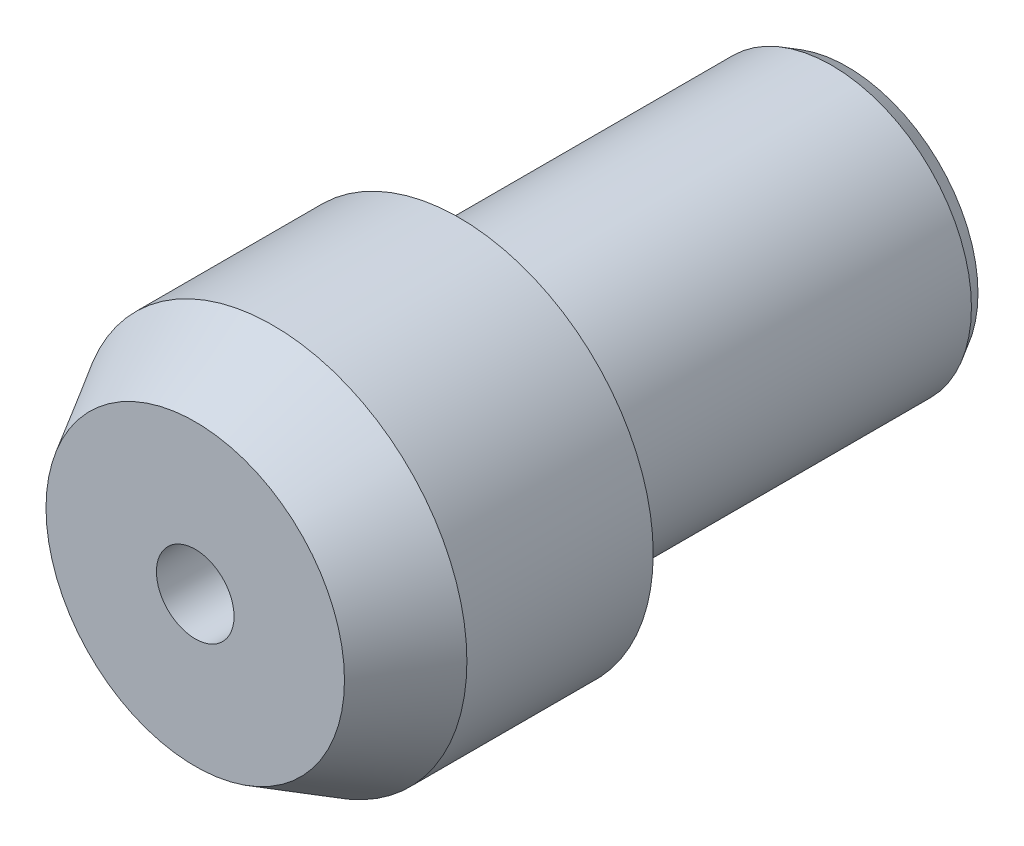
ISO-10303-21;
HEADER;
FILE_DESCRIPTION(('STEP AP214'),'2;1');
FILE_NAME('part.step','',(''),(''),'','','');
FILE_SCHEMA(('AUTOMOTIVE_DESIGN { 1 0 10303 214 1 1 1 1 }'));
ENDSEC;
DATA;
#1=APPLICATION_CONTEXT('core data for automotive mechanical design processes');
#2=APPLICATION_PROTOCOL_DEFINITION('international standard','automotive_design',2000,#1);
#3=PRODUCT_CONTEXT('',#1,'mechanical');
#4=PRODUCT('Part','Part','',(#3));
#5=PRODUCT_RELATED_PRODUCT_CATEGORY('part','',(#4));
#6=PRODUCT_DEFINITION_FORMATION('','',#4);
#7=PRODUCT_DEFINITION_CONTEXT('part definition',#1,'design');
#8=PRODUCT_DEFINITION('design','',#6,#7);
#9=PRODUCT_DEFINITION_SHAPE('','',#8);
#10=(LENGTH_UNIT() NAMED_UNIT(*) SI_UNIT(.MILLI.,.METRE.));
#11=(NAMED_UNIT(*) PLANE_ANGLE_UNIT() SI_UNIT($,.RADIAN.));
#12=(NAMED_UNIT(*) SI_UNIT($,.STERADIAN.) SOLID_ANGLE_UNIT());
#13=UNCERTAINTY_MEASURE_WITH_UNIT(LENGTH_MEASURE(1.E-05),#10,'distance_accuracy_value','');
#14=(GEOMETRIC_REPRESENTATION_CONTEXT(3) GLOBAL_UNCERTAINTY_ASSIGNED_CONTEXT((#13)) GLOBAL_UNIT_ASSIGNED_CONTEXT((#10,
#11,#12)) REPRESENTATION_CONTEXT('',''));
#15=CARTESIAN_POINT('',(0.,0.,0.));
#16=DIRECTION('',(0.,0.,1.));
#17=DIRECTION('',(1.,0.,0.));
#18=AXIS2_PLACEMENT_3D('',#15,#16,#17);
#19=CARTESIAN_POINT('',(0.,0.,-24.));
#20=DIRECTION('',(0.,0.,1.));
#21=DIRECTION('',(1.,0.,0.));
#22=AXIS2_PLACEMENT_3D('',#19,#20,#21);
#23=CONICAL_SURFACE('',#22,9.,0.523598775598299);
#24=CARTESIAN_POINT('',(0.,0.,-25.));
#25=DIRECTION('',(0.,0.,1.));
#26=DIRECTION('',(1.,0.,0.));
#27=AXIS2_PLACEMENT_3D('',#24,#25,#26);
#28=CIRCLE('',#27,8.42264973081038);
#29=CARTESIAN_POINT('',(8.42264973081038,0.,-25.));
#30=VERTEX_POINT('',#29);
#31=EDGE_CURVE('E43',#30,#30,#28,.T.);
#32=ORIENTED_EDGE('',*,*,#31,.T.);
#33=EDGE_LOOP('',(#32));
#34=FACE_BOUND('',#33,.T.);
#35=CARTESIAN_POINT('',(0.,0.,-24.));
#36=DIRECTION('',(0.,0.,1.));
#37=DIRECTION('',(1.,0.,0.));
#38=AXIS2_PLACEMENT_3D('',#35,#36,#37);
#39=CIRCLE('',#38,9.);
#40=CARTESIAN_POINT('',(9.,0.,-24.));
#41=VERTEX_POINT('',#40);
#42=EDGE_CURVE('E8',#41,#41,#39,.T.);
#43=ORIENTED_EDGE('',*,*,#42,.F.);
#44=EDGE_LOOP('',(#43));
#45=FACE_BOUND('',#44,.T.);
#46=ADVANCED_FACE('F12',(#34,#45),#23,.T.);
#47=CARTESIAN_POINT('',(0.,0.,20.));
#48=DIRECTION('',(0.,0.,1.));
#49=DIRECTION('',(1.,0.,0.));
#50=AXIS2_PLACEMENT_3D('',#47,#48,#49);
#51=CYLINDRICAL_SURFACE('',#50,9.);
#52=ORIENTED_EDGE('',*,*,#42,.T.);
#53=EDGE_LOOP('',(#52));
#54=FACE_BOUND('',#53,.T.);
#55=CARTESIAN_POINT('',(0.,0.,0.));
#56=DIRECTION('',(0.,0.,1.));
#57=DIRECTION('',(1.,0.,0.));
#58=AXIS2_PLACEMENT_3D('',#55,#56,#57);
#59=CIRCLE('',#58,9.);
#60=CARTESIAN_POINT('',(9.,0.,0.));
#61=VERTEX_POINT('',#60);
#62=EDGE_CURVE('E18',#61,#61,#59,.T.);
#63=ORIENTED_EDGE('',*,*,#62,.F.);
#64=EDGE_LOOP('',(#63));
#65=FACE_BOUND('',#64,.T.);
#66=ADVANCED_FACE('F72',(#54,#65),#51,.T.);
#67=CARTESIAN_POINT('',(9.,0.,0.));
#68=DIRECTION('',(0.,0.,1.));
#69=DIRECTION('',(1.,0.,0.));
#70=AXIS2_PLACEMENT_3D('',#67,#68,#69);
#71=PLANE('',#70);
#72=CARTESIAN_POINT('',(0.,0.,0.));
#73=DIRECTION('',(0.,0.,1.));
#74=DIRECTION('',(1.,0.,0.));
#75=AXIS2_PLACEMENT_3D('',#72,#73,#74);
#76=CIRCLE('',#75,12.5);
#77=CARTESIAN_POINT('',(12.5,0.,0.));
#78=VERTEX_POINT('',#77);
#79=EDGE_CURVE('E22',#78,#78,#76,.T.);
#80=ORIENTED_EDGE('',*,*,#79,.F.);
#81=EDGE_LOOP('',(#80));
#82=FACE_BOUND('',#81,.T.);
#83=ORIENTED_EDGE('',*,*,#62,.T.);
#84=EDGE_LOOP('',(#83));
#85=FACE_BOUND('',#84,.T.);
#86=ADVANCED_FACE('F77',(#82,#85),#71,.F.);
#87=CARTESIAN_POINT('',(0.,0.,20.));
#88=DIRECTION('',(0.,0.,1.));
#89=DIRECTION('',(1.,0.,0.));
#90=AXIS2_PLACEMENT_3D('',#87,#88,#89);
#91=CYLINDRICAL_SURFACE('',#90,12.5);
#92=ORIENTED_EDGE('',*,*,#79,.T.);
#93=EDGE_LOOP('',(#92));
#94=FACE_BOUND('',#93,.T.);
#95=CARTESIAN_POINT('',(0.,0.,12.));
#96=DIRECTION('',(0.,0.,1.));
#97=DIRECTION('',(1.,0.,0.));
#98=AXIS2_PLACEMENT_3D('',#95,#96,#97);
#99=CIRCLE('',#98,12.5);
#100=CARTESIAN_POINT('',(12.5,0.,12.));
#101=VERTEX_POINT('',#100);
#102=EDGE_CURVE('E26',#101,#101,#99,.T.);
#103=ORIENTED_EDGE('',*,*,#102,.F.);
#104=EDGE_LOOP('',(#103));
#105=FACE_BOUND('',#104,.T.);
#106=ADVANCED_FACE('F68',(#94,#105),#91,.T.);
#107=CARTESIAN_POINT('',(0.,0.,12.));
#108=DIRECTION('',(0.,0.,-1.));
#109=DIRECTION('',(-1.,0.,0.));
#110=AXIS2_PLACEMENT_3D('',#107,#108,#109);
#111=CONICAL_SURFACE('',#110,12.5,0.523598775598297);
#112=CARTESIAN_POINT('',(0.,0.,17.));
#113=DIRECTION('',(0.,0.,1.));
#114=DIRECTION('',(1.,0.,0.));
#115=AXIS2_PLACEMENT_3D('',#112,#113,#114);
#116=CIRCLE('',#115,9.61324865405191);
#117=CARTESIAN_POINT('',(9.61324865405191,0.,17.));
#118=VERTEX_POINT('',#117);
#119=EDGE_CURVE('E31',#118,#118,#116,.T.);
#120=ORIENTED_EDGE('',*,*,#119,.F.);
#121=EDGE_LOOP('',(#120));
#122=FACE_BOUND('',#121,.T.);
#123=ORIENTED_EDGE('',*,*,#102,.T.);
#124=EDGE_LOOP('',(#123));
#125=FACE_BOUND('',#124,.T.);
#126=ADVANCED_FACE('F61',(#122,#125),#111,.T.);
#127=CARTESIAN_POINT('',(2.5,0.,17.));
#128=DIRECTION('',(0.,0.,1.));
#129=DIRECTION('',(1.,0.,0.));
#130=AXIS2_PLACEMENT_3D('',#127,#128,#129);
#131=PLANE('',#130);
#132=ORIENTED_EDGE('',*,*,#119,.T.);
#133=EDGE_LOOP('',(#132));
#134=FACE_BOUND('',#133,.T.);
#135=CARTESIAN_POINT('',(0.,0.,17.));
#136=DIRECTION('',(0.,0.,1.));
#137=DIRECTION('',(1.,0.,0.));
#138=AXIS2_PLACEMENT_3D('',#135,#136,#137);
#139=CIRCLE('',#138,2.5);
#140=CARTESIAN_POINT('',(2.5,0.,17.));
#141=VERTEX_POINT('',#140);
#142=EDGE_CURVE('E34',#141,#141,#139,.T.);
#143=ORIENTED_EDGE('',*,*,#142,.F.);
#144=EDGE_LOOP('',(#143));
#145=FACE_BOUND('',#144,.T.);
#146=ADVANCED_FACE('F56',(#134,#145),#131,.T.);
#147=CARTESIAN_POINT('',(0.,0.,20.));
#148=DIRECTION('',(0.,0.,1.));
#149=DIRECTION('',(1.,0.,0.));
#150=AXIS2_PLACEMENT_3D('',#147,#148,#149);
#151=CYLINDRICAL_SURFACE('',#150,2.5);
#152=CARTESIAN_POINT('',(0.,0.,9.));
#153=DIRECTION('',(0.,0.,1.));
#154=DIRECTION('',(1.,0.,0.));
#155=AXIS2_PLACEMENT_3D('',#152,#153,#154);
#156=CIRCLE('',#155,2.5);
#157=CARTESIAN_POINT('',(2.5,0.,9.));
#158=VERTEX_POINT('',#157);
#159=EDGE_CURVE('E46',#158,#158,#156,.T.);
#160=ORIENTED_EDGE('',*,*,#159,.F.);
#161=EDGE_LOOP('',(#160));
#162=FACE_BOUND('',#161,.T.);
#163=ORIENTED_EDGE('',*,*,#142,.T.);
#164=EDGE_LOOP('',(#163));
#165=FACE_BOUND('',#164,.T.);
#166=ADVANCED_FACE('F52',(#162,#165),#151,.F.);
#167=CARTESIAN_POINT('',(0.,0.,-21.));
#168=DIRECTION('',(0.,0.,1.));
#169=DIRECTION('',(1.,0.,0.));
#170=AXIS2_PLACEMENT_3D('',#167,#168,#169);
#171=PLANE('',#170);
#172=CARTESIAN_POINT('',(0.,0.,-21.));
#173=DIRECTION('',(0.,0.,1.));
#174=DIRECTION('',(1.,0.,0.));
#175=AXIS2_PLACEMENT_3D('',#172,#173,#174);
#176=CIRCLE('',#175,1.);
#177=CARTESIAN_POINT('',(1.,0.,-21.));
#178=VERTEX_POINT('',#177);
#179=EDGE_CURVE('E37',#178,#178,#176,.T.);
#180=ORIENTED_EDGE('',*,*,#179,.F.);
#181=EDGE_LOOP('',(#180));
#182=FACE_BOUND('',#181,.T.);
#183=ADVANCED_FACE('F55',(#182),#171,.F.);
#184=CARTESIAN_POINT('',(0.,0.,20.));
#185=DIRECTION('',(0.,0.,1.));
#186=DIRECTION('',(1.,0.,0.));
#187=AXIS2_PLACEMENT_3D('',#184,#185,#186);
#188=CYLINDRICAL_SURFACE('',#187,1.);
#189=CARTESIAN_POINT('',(0.,0.,-25.));
#190=DIRECTION('',(0.,0.,1.));
#191=DIRECTION('',(1.,0.,0.));
#192=AXIS2_PLACEMENT_3D('',#189,#190,#191);
#193=CIRCLE('',#192,1.);
#194=CARTESIAN_POINT('',(1.,0.,-25.));
#195=VERTEX_POINT('',#194);
#196=EDGE_CURVE('E40',#195,#195,#193,.T.);
#197=ORIENTED_EDGE('',*,*,#196,.F.);
#198=EDGE_LOOP('',(#197));
#199=FACE_BOUND('',#198,.T.);
#200=ORIENTED_EDGE('',*,*,#179,.T.);
#201=EDGE_LOOP('',(#200));
#202=FACE_BOUND('',#201,.T.);
#203=ADVANCED_FACE('F84',(#199,#202),#188,.F.);
#204=CARTESIAN_POINT('',(1.,0.,-25.));
#205=DIRECTION('',(0.,0.,1.));
#206=DIRECTION('',(1.,0.,0.));
#207=AXIS2_PLACEMENT_3D('',#204,#205,#206);
#208=PLANE('',#207);
#209=ORIENTED_EDGE('',*,*,#31,.F.);
#210=EDGE_LOOP('',(#209));
#211=FACE_BOUND('',#210,.T.);
#212=ORIENTED_EDGE('',*,*,#196,.T.);
#213=EDGE_LOOP('',(#212));
#214=FACE_BOUND('',#213,.T.);
#215=ADVANCED_FACE('F81',(#211,#214),#208,.F.);
#216=CARTESIAN_POINT('',(0.,0.,9.));
#217=DIRECTION('',(0.,0.,1.));
#218=DIRECTION('',(1.,0.,0.));
#219=AXIS2_PLACEMENT_3D('',#216,#217,#218);
#220=PLANE('',#219);
#221=ORIENTED_EDGE('',*,*,#159,.T.);
#222=EDGE_LOOP('',(#221));
#223=FACE_BOUND('',#222,.T.);
#224=ADVANCED_FACE('F50',(#223),#220,.T.);
#225=CLOSED_SHELL('',(#46,#66,#86,#106,#126,#146,#166,#183,#203,#215,#224));
#226=MANIFOLD_SOLID_BREP('B1',#225);
#227=ADVANCED_BREP_SHAPE_REPRESENTATION('',(#18,#226),#14);
#228=SHAPE_DEFINITION_REPRESENTATION(#9,#227);
ENDSEC;
END-ISO-10303-21;
